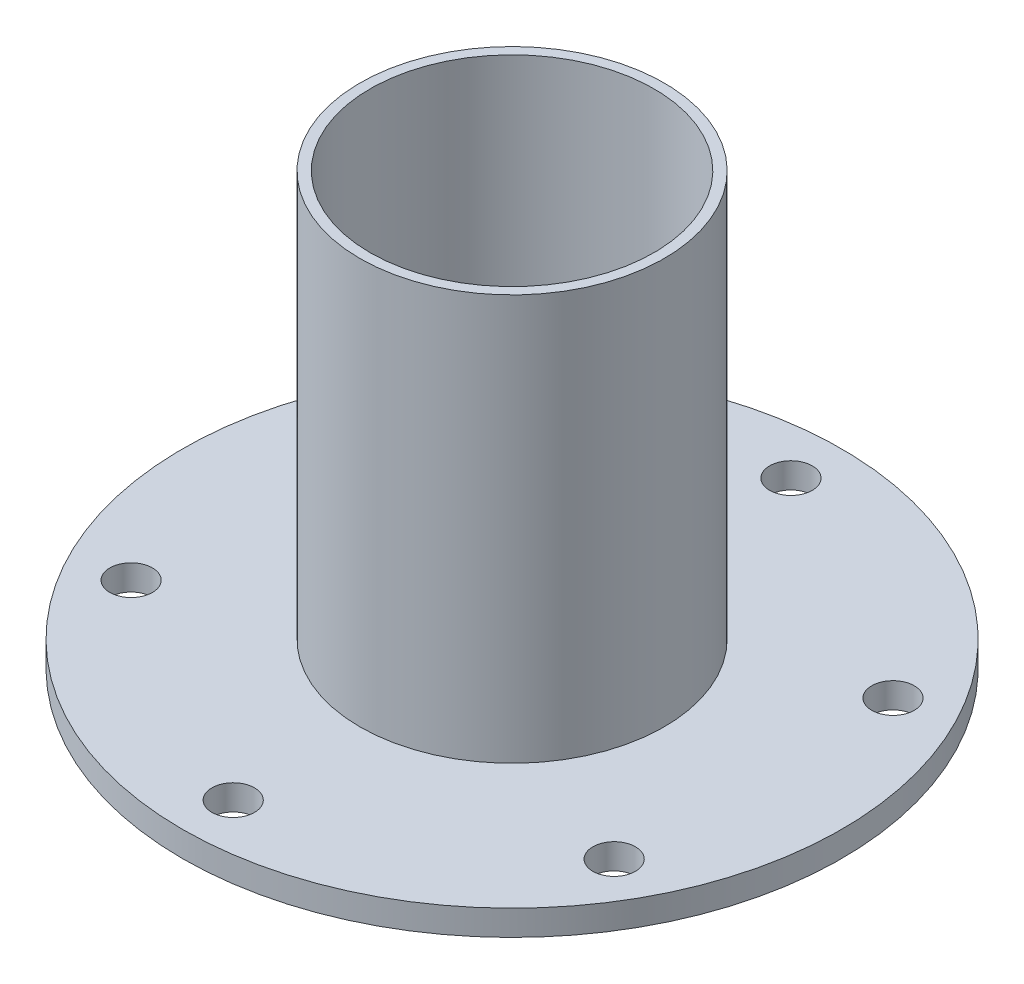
ISO-10303-21;
HEADER;
FILE_DESCRIPTION(('STEP AP214'),'2;1');
FILE_NAME('part.step','',(''),(''),'','','');
FILE_SCHEMA(('AUTOMOTIVE_DESIGN { 1 0 10303 214 1 1 1 1 }'));
ENDSEC;
DATA;
#1=APPLICATION_CONTEXT('core data for automotive mechanical design processes');
#2=APPLICATION_PROTOCOL_DEFINITION('international standard','automotive_design',2000,#1);
#3=PRODUCT_CONTEXT('',#1,'mechanical');
#4=PRODUCT('Part','Part','',(#3));
#5=PRODUCT_RELATED_PRODUCT_CATEGORY('part','',(#4));
#6=PRODUCT_DEFINITION_FORMATION('','',#4);
#7=PRODUCT_DEFINITION_CONTEXT('part definition',#1,'design');
#8=PRODUCT_DEFINITION('design','',#6,#7);
#9=PRODUCT_DEFINITION_SHAPE('','',#8);
#10=(LENGTH_UNIT() NAMED_UNIT(*) SI_UNIT(.MILLI.,.METRE.));
#11=(NAMED_UNIT(*) PLANE_ANGLE_UNIT() SI_UNIT($,.RADIAN.));
#12=(NAMED_UNIT(*) SI_UNIT($,.STERADIAN.) SOLID_ANGLE_UNIT());
#13=UNCERTAINTY_MEASURE_WITH_UNIT(LENGTH_MEASURE(1.E-05),#10,'distance_accuracy_value','');
#14=(GEOMETRIC_REPRESENTATION_CONTEXT(3) GLOBAL_UNCERTAINTY_ASSIGNED_CONTEXT((#13)) GLOBAL_UNIT_ASSIGNED_CONTEXT((#10,
#11,#12)) REPRESENTATION_CONTEXT('',''));
#15=CARTESIAN_POINT('',(0.,0.,0.));
#16=DIRECTION('',(0.,0.,1.));
#17=DIRECTION('',(1.,0.,0.));
#18=AXIS2_PLACEMENT_3D('',#15,#16,#17);
#19=CARTESIAN_POINT('',(0.,3.175,0.));
#20=DIRECTION('',(0.,1.,0.));
#21=DIRECTION('',(0.,0.,1.));
#22=AXIS2_PLACEMENT_3D('',#19,#20,#21);
#23=PLANE('',#22);
#24=CARTESIAN_POINT('',(0.,3.175,0.));
#25=DIRECTION('',(0.,1.,0.));
#26=DIRECTION('',(0.,0.,1.));
#27=AXIS2_PLACEMENT_3D('',#24,#25,#26);
#28=CIRCLE('',#27,19.05);
#29=CARTESIAN_POINT('',(0.,3.175,19.05));
#30=VERTEX_POINT('',#29);
#31=EDGE_CURVE('E85',#30,#30,#28,.T.);
#32=ORIENTED_EDGE('',*,*,#31,.F.);
#33=EDGE_LOOP('',(#32));
#34=FACE_BOUND('',#33,.T.);
#35=CARTESIAN_POINT('',(-30.2459372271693,3.175,17.4625000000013));
#36=DIRECTION('',(0.,1.,0.));
#37=DIRECTION('',(0.,0.,1.));
#38=AXIS2_PLACEMENT_3D('',#35,#36,#37);
#39=CIRCLE('',#38,2.66700000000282);
#40=CARTESIAN_POINT('',(-30.2459372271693,3.175,20.1295000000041));
#41=VERTEX_POINT('',#40);
#42=EDGE_CURVE('E70',#41,#41,#39,.T.);
#43=ORIENTED_EDGE('',*,*,#42,.F.);
#44=EDGE_LOOP('',(#43));
#45=FACE_BOUND('',#44,.T.);
#46=CARTESIAN_POINT('',(30.2459372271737,3.175,17.4624999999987));
#47=DIRECTION('',(0.,1.,0.));
#48=DIRECTION('',(0.,0.,1.));
#49=AXIS2_PLACEMENT_3D('',#46,#47,#48);
#50=CIRCLE('',#49,2.66700000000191);
#51=CARTESIAN_POINT('',(30.2459372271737,3.175,20.1295000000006));
#52=VERTEX_POINT('',#51);
#53=EDGE_CURVE('E58',#52,#52,#50,.T.);
#54=ORIENTED_EDGE('',*,*,#53,.F.);
#55=EDGE_LOOP('',(#54));
#56=FACE_BOUND('',#55,.T.);
#57=CARTESIAN_POINT('',(0.,3.175,-34.925));
#58=DIRECTION('',(0.,1.,0.));
#59=DIRECTION('',(0.,0.,1.));
#60=AXIS2_PLACEMENT_3D('',#57,#58,#59);
#61=CIRCLE('',#60,2.667);
#62=CARTESIAN_POINT('',(0.,3.175,-32.258));
#63=VERTEX_POINT('',#62);
#64=EDGE_CURVE('E47',#63,#63,#61,.T.);
#65=ORIENTED_EDGE('',*,*,#64,.F.);
#66=EDGE_LOOP('',(#65));
#67=FACE_BOUND('',#66,.T.);
#68=CARTESIAN_POINT('',(0.,3.175,0.));
#69=DIRECTION('',(0.,1.,0.));
#70=DIRECTION('',(0.,0.,1.));
#71=AXIS2_PLACEMENT_3D('',#68,#69,#70);
#72=CIRCLE('',#71,41.275);
#73=CARTESIAN_POINT('',(0.,3.175,41.275));
#74=VERTEX_POINT('',#73);
#75=EDGE_CURVE('E38',#74,#74,#72,.T.);
#76=ORIENTED_EDGE('',*,*,#75,.T.);
#77=EDGE_LOOP('',(#76));
#78=FACE_BOUND('',#77,.T.);
#79=CARTESIAN_POINT('',(30.2459372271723,3.175,-17.4625000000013));
#80=DIRECTION('',(0.,1.,0.));
#81=DIRECTION('',(0.,0.,1.));
#82=AXIS2_PLACEMENT_3D('',#79,#80,#81);
#83=CIRCLE('',#82,2.66700000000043);
#84=CARTESIAN_POINT('',(30.2459372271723,3.175,-14.7955000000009));
#85=VERTEX_POINT('',#84);
#86=EDGE_CURVE('E52',#85,#85,#83,.T.);
#87=ORIENTED_EDGE('',*,*,#86,.F.);
#88=EDGE_LOOP('',(#87));
#89=FACE_BOUND('',#88,.T.);
#90=CARTESIAN_POINT('',(2.96505336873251E-12,3.175,34.925));
#91=DIRECTION('',(0.,1.,0.));
#92=DIRECTION('',(0.,0.,1.));
#93=AXIS2_PLACEMENT_3D('',#90,#91,#92);
#94=CIRCLE('',#93,2.66700000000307);
#95=CARTESIAN_POINT('',(2.96505336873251E-12,3.175,37.5920000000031));
#96=VERTEX_POINT('',#95);
#97=EDGE_CURVE('E64',#96,#96,#94,.T.);
#98=ORIENTED_EDGE('',*,*,#97,.F.);
#99=EDGE_LOOP('',(#98));
#100=FACE_BOUND('',#99,.T.);
#101=CARTESIAN_POINT('',(-30.2459372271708,3.175,-17.4624999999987));
#102=DIRECTION('',(0.,1.,0.));
#103=DIRECTION('',(0.,0.,1.));
#104=AXIS2_PLACEMENT_3D('',#101,#102,#103);
#105=CIRCLE('',#104,2.6670000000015);
#106=CARTESIAN_POINT('',(-30.2459372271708,3.175,-14.7954999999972));
#107=VERTEX_POINT('',#106);
#108=EDGE_CURVE('E76',#107,#107,#105,.T.);
#109=ORIENTED_EDGE('',*,*,#108,.F.);
#110=EDGE_LOOP('',(#109));
#111=FACE_BOUND('',#110,.T.);
#112=ADVANCED_FACE('F31',(#34,#45,#56,#67,#78,#89,#100,#111),#23,.T.);
#113=CARTESIAN_POINT('',(0.,0.,0.));
#114=DIRECTION('',(0.,1.,0.));
#115=DIRECTION('',(0.,0.,1.));
#116=AXIS2_PLACEMENT_3D('',#113,#114,#115);
#117=PLANE('',#116);
#118=CARTESIAN_POINT('',(0.,0.,0.));
#119=DIRECTION('',(0.,1.,0.));
#120=DIRECTION('',(0.,0.,1.));
#121=AXIS2_PLACEMENT_3D('',#118,#119,#120);
#122=CIRCLE('',#121,41.275);
#123=CARTESIAN_POINT('',(0.,0.,41.275));
#124=VERTEX_POINT('',#123);
#125=EDGE_CURVE('E42',#124,#124,#122,.T.);
#126=ORIENTED_EDGE('',*,*,#125,.F.);
#127=EDGE_LOOP('',(#126));
#128=FACE_BOUND('',#127,.T.);
#129=CARTESIAN_POINT('',(0.,0.,-34.925));
#130=DIRECTION('',(0.,1.,0.));
#131=DIRECTION('',(0.,0.,1.));
#132=AXIS2_PLACEMENT_3D('',#129,#130,#131);
#133=CIRCLE('',#132,2.667);
#134=CARTESIAN_POINT('',(0.,0.,-32.258));
#135=VERTEX_POINT('',#134);
#136=EDGE_CURVE('E49',#135,#135,#133,.T.);
#137=ORIENTED_EDGE('',*,*,#136,.T.);
#138=EDGE_LOOP('',(#137));
#139=FACE_BOUND('',#138,.T.);
#140=CARTESIAN_POINT('',(30.2459372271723,0.,-17.4625000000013));
#141=DIRECTION('',(0.,1.,0.));
#142=DIRECTION('',(0.,0.,1.));
#143=AXIS2_PLACEMENT_3D('',#140,#141,#142);
#144=CIRCLE('',#143,2.66700000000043);
#145=CARTESIAN_POINT('',(30.2459372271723,0.,-14.7955000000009));
#146=VERTEX_POINT('',#145);
#147=EDGE_CURVE('E55',#146,#146,#144,.T.);
#148=ORIENTED_EDGE('',*,*,#147,.T.);
#149=EDGE_LOOP('',(#148));
#150=FACE_BOUND('',#149,.T.);
#151=CARTESIAN_POINT('',(30.2459372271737,0.,17.4624999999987));
#152=DIRECTION('',(0.,1.,0.));
#153=DIRECTION('',(0.,0.,1.));
#154=AXIS2_PLACEMENT_3D('',#151,#152,#153);
#155=CIRCLE('',#154,2.66700000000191);
#156=CARTESIAN_POINT('',(30.2459372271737,0.,20.1295000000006));
#157=VERTEX_POINT('',#156);
#158=EDGE_CURVE('E61',#157,#157,#155,.T.);
#159=ORIENTED_EDGE('',*,*,#158,.T.);
#160=EDGE_LOOP('',(#159));
#161=FACE_BOUND('',#160,.T.);
#162=CARTESIAN_POINT('',(2.96505336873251E-12,0.,34.925));
#163=DIRECTION('',(0.,1.,0.));
#164=DIRECTION('',(0.,0.,1.));
#165=AXIS2_PLACEMENT_3D('',#162,#163,#164);
#166=CIRCLE('',#165,2.66700000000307);
#167=CARTESIAN_POINT('',(2.96505336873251E-12,0.,37.5920000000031));
#168=VERTEX_POINT('',#167);
#169=EDGE_CURVE('E67',#168,#168,#166,.T.);
#170=ORIENTED_EDGE('',*,*,#169,.T.);
#171=EDGE_LOOP('',(#170));
#172=FACE_BOUND('',#171,.T.);
#173=CARTESIAN_POINT('',(-30.2459372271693,0.,17.4625000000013));
#174=DIRECTION('',(0.,1.,0.));
#175=DIRECTION('',(0.,0.,1.));
#176=AXIS2_PLACEMENT_3D('',#173,#174,#175);
#177=CIRCLE('',#176,2.66700000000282);
#178=CARTESIAN_POINT('',(-30.2459372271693,0.,20.1295000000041));
#179=VERTEX_POINT('',#178);
#180=EDGE_CURVE('E73',#179,#179,#177,.T.);
#181=ORIENTED_EDGE('',*,*,#180,.T.);
#182=EDGE_LOOP('',(#181));
#183=FACE_BOUND('',#182,.T.);
#184=CARTESIAN_POINT('',(-30.2459372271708,0.,-17.4624999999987));
#185=DIRECTION('',(0.,1.,0.));
#186=DIRECTION('',(0.,0.,1.));
#187=AXIS2_PLACEMENT_3D('',#184,#185,#186);
#188=CIRCLE('',#187,2.6670000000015);
#189=CARTESIAN_POINT('',(-30.2459372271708,0.,-14.7954999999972));
#190=VERTEX_POINT('',#189);
#191=EDGE_CURVE('E79',#190,#190,#188,.T.);
#192=ORIENTED_EDGE('',*,*,#191,.T.);
#193=EDGE_LOOP('',(#192));
#194=FACE_BOUND('',#193,.T.);
#195=ADVANCED_FACE('F113',(#128,#139,#150,#161,#172,#183,#194),#117,.F.);
#196=CARTESIAN_POINT('',(0.,3.175,0.));
#197=DIRECTION('',(0.,-1.,0.));
#198=DIRECTION('',(0.,0.,-1.));
#199=AXIS2_PLACEMENT_3D('',#196,#197,#198);
#200=CYLINDRICAL_SURFACE('',#199,41.275);
#201=ORIENTED_EDGE('',*,*,#75,.F.);
#202=EDGE_LOOP('',(#201));
#203=FACE_BOUND('',#202,.T.);
#204=ORIENTED_EDGE('',*,*,#125,.T.);
#205=EDGE_LOOP('',(#204));
#206=FACE_BOUND('',#205,.T.);
#207=ADVANCED_FACE('F33',(#203,#206),#200,.T.);
#208=CARTESIAN_POINT('',(0.,3.175,-34.925));
#209=DIRECTION('',(0.,-1.,0.));
#210=DIRECTION('',(0.,0.,-1.));
#211=AXIS2_PLACEMENT_3D('',#208,#209,#210);
#212=CYLINDRICAL_SURFACE('',#211,2.667);
#213=ORIENTED_EDGE('',*,*,#64,.T.);
#214=EDGE_LOOP('',(#213));
#215=FACE_BOUND('',#214,.T.);
#216=ORIENTED_EDGE('',*,*,#136,.F.);
#217=EDGE_LOOP('',(#216));
#218=FACE_BOUND('',#217,.T.);
#219=ADVANCED_FACE('F190',(#215,#218),#212,.F.);
#220=CARTESIAN_POINT('',(30.2459372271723,3.175,-17.4625000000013));
#221=DIRECTION('',(0.,-1.,0.));
#222=DIRECTION('',(0.,0.,-1.));
#223=AXIS2_PLACEMENT_3D('',#220,#221,#222);
#224=CYLINDRICAL_SURFACE('',#223,2.66700000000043);
#225=ORIENTED_EDGE('',*,*,#86,.T.);
#226=EDGE_LOOP('',(#225));
#227=FACE_BOUND('',#226,.T.);
#228=ORIENTED_EDGE('',*,*,#147,.F.);
#229=EDGE_LOOP('',(#228));
#230=FACE_BOUND('',#229,.T.);
#231=ADVANCED_FACE('F180',(#227,#230),#224,.F.);
#232=CARTESIAN_POINT('',(30.2459372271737,3.175,17.4624999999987));
#233=DIRECTION('',(0.,-1.,0.));
#234=DIRECTION('',(0.,0.,-1.));
#235=AXIS2_PLACEMENT_3D('',#232,#233,#234);
#236=CYLINDRICAL_SURFACE('',#235,2.66700000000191);
#237=ORIENTED_EDGE('',*,*,#53,.T.);
#238=EDGE_LOOP('',(#237));
#239=FACE_BOUND('',#238,.T.);
#240=ORIENTED_EDGE('',*,*,#158,.F.);
#241=EDGE_LOOP('',(#240));
#242=FACE_BOUND('',#241,.T.);
#243=ADVANCED_FACE('F170',(#239,#242),#236,.F.);
#244=CARTESIAN_POINT('',(2.96505336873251E-12,3.175,34.925));
#245=DIRECTION('',(0.,-1.,0.));
#246=DIRECTION('',(0.,0.,-1.));
#247=AXIS2_PLACEMENT_3D('',#244,#245,#246);
#248=CYLINDRICAL_SURFACE('',#247,2.66700000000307);
#249=ORIENTED_EDGE('',*,*,#97,.T.);
#250=EDGE_LOOP('',(#249));
#251=FACE_BOUND('',#250,.T.);
#252=ORIENTED_EDGE('',*,*,#169,.F.);
#253=EDGE_LOOP('',(#252));
#254=FACE_BOUND('',#253,.T.);
#255=ADVANCED_FACE('F160',(#251,#254),#248,.F.);
#256=CARTESIAN_POINT('',(-30.2459372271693,3.175,17.4625000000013));
#257=DIRECTION('',(0.,-1.,0.));
#258=DIRECTION('',(0.,0.,-1.));
#259=AXIS2_PLACEMENT_3D('',#256,#257,#258);
#260=CYLINDRICAL_SURFACE('',#259,2.66700000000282);
#261=ORIENTED_EDGE('',*,*,#42,.T.);
#262=EDGE_LOOP('',(#261));
#263=FACE_BOUND('',#262,.T.);
#264=ORIENTED_EDGE('',*,*,#180,.F.);
#265=EDGE_LOOP('',(#264));
#266=FACE_BOUND('',#265,.T.);
#267=ADVANCED_FACE('F108',(#263,#266),#260,.F.);
#268=CARTESIAN_POINT('',(-30.2459372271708,3.175,-17.4624999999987));
#269=DIRECTION('',(0.,-1.,0.));
#270=DIRECTION('',(0.,0.,-1.));
#271=AXIS2_PLACEMENT_3D('',#268,#269,#270);
#272=CYLINDRICAL_SURFACE('',#271,2.6670000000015);
#273=ORIENTED_EDGE('',*,*,#108,.T.);
#274=EDGE_LOOP('',(#273));
#275=FACE_BOUND('',#274,.T.);
#276=ORIENTED_EDGE('',*,*,#191,.F.);
#277=EDGE_LOOP('',(#276));
#278=FACE_BOUND('',#277,.T.);
#279=ADVANCED_FACE('F99',(#275,#278),#272,.F.);
#280=CARTESIAN_POINT('',(0.,53.975,0.));
#281=DIRECTION('',(0.,1.,0.));
#282=DIRECTION('',(0.,0.,1.));
#283=AXIS2_PLACEMENT_3D('',#280,#281,#282);
#284=PLANE('',#283);
#285=CARTESIAN_POINT('',(0.,53.975,0.));
#286=DIRECTION('',(0.,1.,0.));
#287=DIRECTION('',(0.,0.,1.));
#288=AXIS2_PLACEMENT_3D('',#285,#286,#287);
#289=CIRCLE('',#288,19.05);
#290=CARTESIAN_POINT('',(0.,53.975,19.05));
#291=VERTEX_POINT('',#290);
#292=EDGE_CURVE('E82',#291,#291,#289,.T.);
#293=ORIENTED_EDGE('',*,*,#292,.T.);
#294=EDGE_LOOP('',(#293));
#295=FACE_BOUND('',#294,.T.);
#296=CARTESIAN_POINT('',(0.,53.975,0.));
#297=DIRECTION('',(0.,1.,0.));
#298=DIRECTION('',(0.,0.,1.));
#299=AXIS2_PLACEMENT_3D('',#296,#297,#298);
#300=CIRCLE('',#299,17.78);
#301=CARTESIAN_POINT('',(0.,53.975,17.78));
#302=VERTEX_POINT('',#301);
#303=EDGE_CURVE('E88',#302,#302,#300,.T.);
#304=ORIENTED_EDGE('',*,*,#303,.F.);
#305=EDGE_LOOP('',(#304));
#306=FACE_BOUND('',#305,.T.);
#307=ADVANCED_FACE('F96',(#295,#306),#284,.T.);
#308=CARTESIAN_POINT('',(0.,53.975,0.));
#309=DIRECTION('',(0.,-1.,0.));
#310=DIRECTION('',(0.,0.,-1.));
#311=AXIS2_PLACEMENT_3D('',#308,#309,#310);
#312=CYLINDRICAL_SURFACE('',#311,19.05);
#313=ORIENTED_EDGE('',*,*,#292,.F.);
#314=EDGE_LOOP('',(#313));
#315=FACE_BOUND('',#314,.T.);
#316=ORIENTED_EDGE('',*,*,#31,.T.);
#317=EDGE_LOOP('',(#316));
#318=FACE_BOUND('',#317,.T.);
#319=ADVANCED_FACE('F98',(#315,#318),#312,.T.);
#320=CARTESIAN_POINT('',(0.,53.975,0.));
#321=DIRECTION('',(0.,-1.,0.));
#322=DIRECTION('',(0.,0.,-1.));
#323=AXIS2_PLACEMENT_3D('',#320,#321,#322);
#324=CYLINDRICAL_SURFACE('',#323,17.78);
#325=ORIENTED_EDGE('',*,*,#303,.T.);
#326=EDGE_LOOP('',(#325));
#327=FACE_BOUND('',#326,.T.);
#328=CARTESIAN_POINT('',(0.,3.175,0.));
#329=DIRECTION('',(0.,1.,0.));
#330=DIRECTION('',(0.,0.,1.));
#331=AXIS2_PLACEMENT_3D('',#328,#329,#330);
#332=CIRCLE('',#331,17.78);
#333=CARTESIAN_POINT('',(0.,3.175,17.78));
#334=VERTEX_POINT('',#333);
#335=EDGE_CURVE('E10',#334,#334,#332,.F.);
#336=ORIENTED_EDGE('',*,*,#335,.T.);
#337=EDGE_LOOP('',(#336));
#338=FACE_BOUND('',#337,.T.);
#339=ADVANCED_FACE('F94',(#327,#338),#324,.F.);
#340=ORIENTED_EDGE('',*,*,#335,.F.);
#341=EDGE_LOOP('',(#340));
#342=FACE_BOUND('',#341,.T.);
#343=ADVANCED_FACE('F116',(#342),#23,.T.);
#344=CLOSED_SHELL('',(#112,#195,#207,#219,#231,#243,#255,#267,#279,#307,#319,#339,#343));
#345=MANIFOLD_SOLID_BREP('B2',#344);
#346=ADVANCED_BREP_SHAPE_REPRESENTATION('',(#18,#345),#14);
#347=SHAPE_DEFINITION_REPRESENTATION(#9,#346);
ENDSEC;
END-ISO-10303-21;
